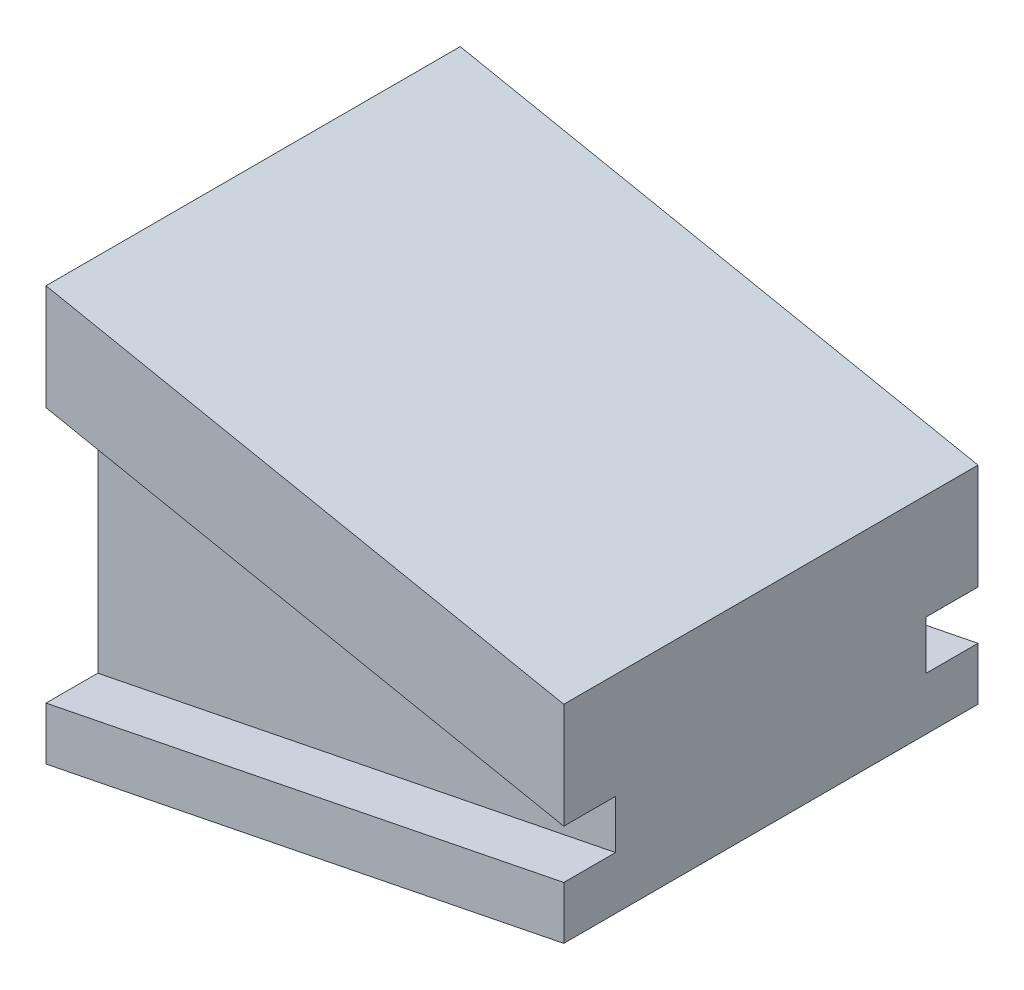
from build123d import *

# Parameters (mm, degrees)
BOSS_EXTRUDE1_DEPTH = 40
CUT_EXTRUDE1_START  = -5
CUT_EXTRUDE1_DEPTH  = 76.710678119


with BuildPart() as part:
    # Sketch1 → Boss-Extrude1 (new body)
    with BuildSketch(Plane.XY):
        Polygon((0, 0), (0, 20), (-50, 30), (-50, -10), align=None)
    extrude(amount=BOSS_EXTRUDE1_DEPTH)

    # Sketch5 → Cut-Extrude1 (cut)
    with BuildSketch(Plane.XY.offset(40).offset(CUT_EXTRUDE1_START)):
        Polygon((0, 9.801960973), (-50, 19.801960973), (-50, -4.900980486), (0, 5.099019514), align=None)
    cut_extrude1 = extrude(amount=CUT_EXTRUDE1_DEPTH, mode=Mode.SUBTRACT)

    # Mirror1: Cut-Extrude1 across plane
    add(cut_extrude1.mirror(Plane.XY.offset(20)), mode=Mode.SUBTRACT)


solid = part.part
